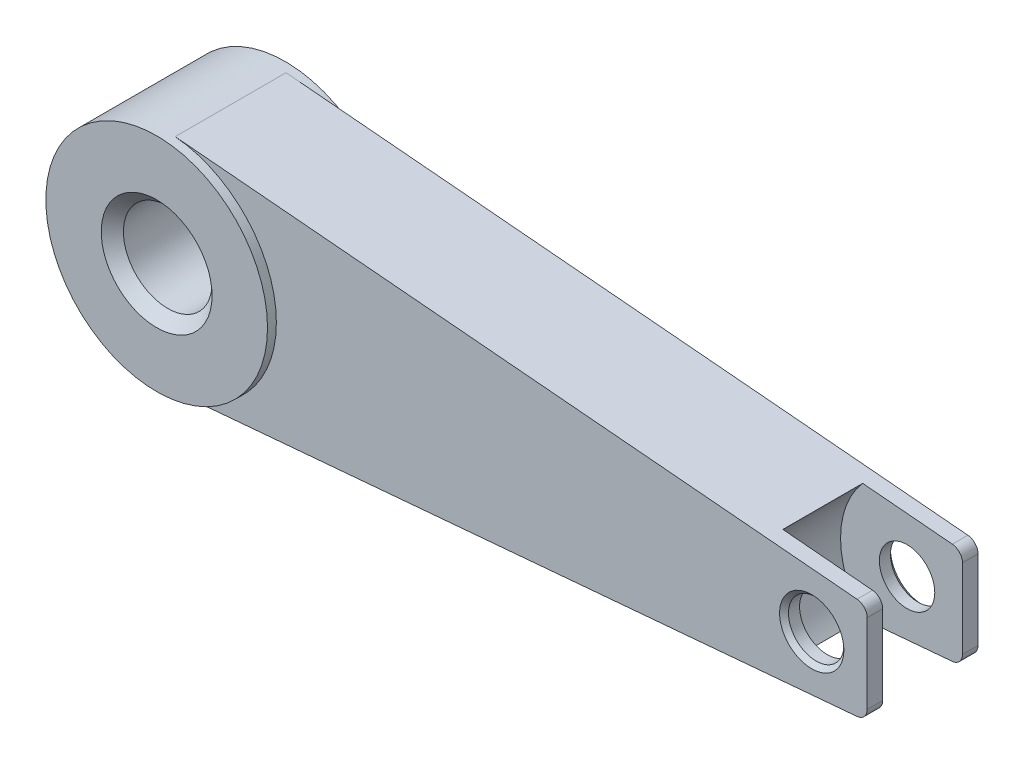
ISO-10303-21;
HEADER;
FILE_DESCRIPTION(('STEP AP214'),'2;1');
FILE_NAME('part.step','',(''),(''),'','','');
FILE_SCHEMA(('AUTOMOTIVE_DESIGN { 1 0 10303 214 1 1 1 1 }'));
ENDSEC;
DATA;
#1=APPLICATION_CONTEXT('core data for automotive mechanical design processes');
#2=APPLICATION_PROTOCOL_DEFINITION('international standard','automotive_design',2000,#1);
#3=PRODUCT_CONTEXT('',#1,'mechanical');
#4=PRODUCT('Part','Part','',(#3));
#5=PRODUCT_RELATED_PRODUCT_CATEGORY('part','',(#4));
#6=PRODUCT_DEFINITION_FORMATION('','',#4);
#7=PRODUCT_DEFINITION_CONTEXT('part definition',#1,'design');
#8=PRODUCT_DEFINITION('design','',#6,#7);
#9=PRODUCT_DEFINITION_SHAPE('','',#8);
#10=(LENGTH_UNIT() NAMED_UNIT(*) SI_UNIT(.MILLI.,.METRE.));
#11=(NAMED_UNIT(*) PLANE_ANGLE_UNIT() SI_UNIT($,.RADIAN.));
#12=(NAMED_UNIT(*) SI_UNIT($,.STERADIAN.) SOLID_ANGLE_UNIT());
#13=UNCERTAINTY_MEASURE_WITH_UNIT(LENGTH_MEASURE(1.E-05),#10,'distance_accuracy_value','');
#14=(GEOMETRIC_REPRESENTATION_CONTEXT(3) GLOBAL_UNCERTAINTY_ASSIGNED_CONTEXT((#13)) GLOBAL_UNIT_ASSIGNED_CONTEXT((#10,
#11,#12)) REPRESENTATION_CONTEXT('',''));
#15=CARTESIAN_POINT('',(0.,0.,0.));
#16=DIRECTION('',(0.,0.,1.));
#17=DIRECTION('',(1.,0.,0.));
#18=AXIS2_PLACEMENT_3D('',#15,#16,#17);
#19=CARTESIAN_POINT('',(31.6509485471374,2.24999999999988,0.4));
#20=DIRECTION('',(1.,0.,0.));
#21=DIRECTION('',(0.,0.,-1.));
#22=AXIS2_PLACEMENT_3D('',#19,#20,#21);
#23=PLANE('',#22);
#24=DIRECTION('',(0.,-1.,0.));
#25=VECTOR('',#24,1.);
#26=CARTESIAN_POINT('',(31.6509485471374,2.24999999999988,1.1));
#27=LINE('',#26,#25);
#28=CARTESIAN_POINT('',(31.6509485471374,1.79183441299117,1.1));
#29=VERTEX_POINT('',#28);
#30=CARTESIAN_POINT('',(31.6509485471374,-1.79183441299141,1.1));
#31=VERTEX_POINT('',#30);
#32=EDGE_CURVE('E144',#29,#31,#27,.T.);
#33=ORIENTED_EDGE('',*,*,#32,.T.);
#34=DIRECTION('',(0.,0.,1.));
#35=VECTOR('',#34,1.);
#36=CARTESIAN_POINT('',(31.6509485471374,-1.79183441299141,0.4));
#37=LINE('',#36,#35);
#38=CARTESIAN_POINT('',(31.6509485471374,-1.79183441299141,0.4));
#39=VERTEX_POINT('',#38);
#40=EDGE_CURVE('E63',#31,#39,#37,.F.);
#41=ORIENTED_EDGE('',*,*,#40,.T.);
#42=DIRECTION('',(0.,1.,0.));
#43=VECTOR('',#42,1.);
#44=CARTESIAN_POINT('',(31.6509485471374,2.24999999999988,0.4));
#45=LINE('',#44,#43);
#46=CARTESIAN_POINT('',(31.6509485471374,1.79183441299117,0.4));
#47=VERTEX_POINT('',#46);
#48=EDGE_CURVE('E183',#39,#47,#45,.T.);
#49=ORIENTED_EDGE('',*,*,#48,.T.);
#50=DIRECTION('',(0.,0.,1.));
#51=VECTOR('',#50,1.);
#52=CARTESIAN_POINT('',(31.6509485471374,1.79183441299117,0.4));
#53=LINE('',#52,#51);
#54=EDGE_CURVE('E295',#47,#29,#53,.T.);
#55=ORIENTED_EDGE('',*,*,#54,.T.);
#56=EDGE_LOOP('',(#33,#41,#49,#55));
#57=FACE_BOUND('',#56,.T.);
#58=ADVANCED_FACE('F41',(#57),#23,.T.);
#59=CARTESIAN_POINT('',(0.,0.,5.8));
#60=DIRECTION('',(0.,0.,-1.));
#61=DIRECTION('',(-1.,0.,0.));
#62=AXIS2_PLACEMENT_3D('',#59,#60,#61);
#63=CYLINDRICAL_SURFACE('',#62,5.);
#64=CARTESIAN_POINT('',(0.,0.,5.4));
#65=DIRECTION('',(0.,0.,1.));
#66=DIRECTION('',(1.,0.,0.));
#67=AXIS2_PLACEMENT_3D('',#64,#65,#66);
#68=CIRCLE('',#67,5.);
#69=CARTESIAN_POINT('',(0.435778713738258,-4.98097349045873,5.4));
#70=VERTEX_POINT('',#69);
#71=CARTESIAN_POINT('',(0.435778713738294,4.98097349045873,5.4));
#72=VERTEX_POINT('',#71);
#73=EDGE_CURVE('E202',#70,#72,#68,.T.);
#74=ORIENTED_EDGE('',*,*,#73,.T.);
#75=DIRECTION('',(0.,0.,1.));
#76=VECTOR('',#75,1.);
#77=CARTESIAN_POINT('',(0.435778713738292,4.98097349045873,0.4));
#78=LINE('',#77,#76);
#79=CARTESIAN_POINT('',(0.435778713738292,4.98097349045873,0.4));
#80=VERTEX_POINT('',#79);
#81=EDGE_CURVE('E190',#80,#72,#78,.T.);
#82=ORIENTED_EDGE('',*,*,#81,.F.);
#83=CARTESIAN_POINT('',(0.,0.,0.399999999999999));
#84=DIRECTION('',(0.,0.,1.));
#85=DIRECTION('',(1.,0.,0.));
#86=AXIS2_PLACEMENT_3D('',#83,#84,#85);
#87=CIRCLE('',#86,5.);
#88=CARTESIAN_POINT('',(0.435778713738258,-4.98097349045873,0.4));
#89=VERTEX_POINT('',#88);
#90=EDGE_CURVE('E209',#89,#80,#87,.T.);
#91=ORIENTED_EDGE('',*,*,#90,.F.);
#92=DIRECTION('',(0.,0.,1.));
#93=VECTOR('',#92,1.);
#94=CARTESIAN_POINT('',(0.435778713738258,-4.98097349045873,0.4));
#95=LINE('',#94,#93);
#96=EDGE_CURVE('E189',#89,#70,#95,.T.);
#97=ORIENTED_EDGE('',*,*,#96,.T.);
#98=EDGE_LOOP('',(#74,#82,#91,#97));
#99=FACE_BOUND('',#98,.T.);
#100=CARTESIAN_POINT('',(0.,0.,5.8));
#101=DIRECTION('',(0.,0.,1.));
#102=DIRECTION('',(1.,0.,0.));
#103=AXIS2_PLACEMENT_3D('',#100,#101,#102);
#104=CIRCLE('',#103,5.);
#105=CARTESIAN_POINT('',(5.,0.,5.8));
#106=VERTEX_POINT('',#105);
#107=EDGE_CURVE('E198',#106,#106,#104,.T.);
#108=ORIENTED_EDGE('',*,*,#107,.F.);
#109=EDGE_LOOP('',(#108));
#110=FACE_BOUND('',#109,.T.);
#111=CARTESIAN_POINT('',(0.,0.,0.));
#112=DIRECTION('',(0.,0.,1.));
#113=DIRECTION('',(1.,0.,0.));
#114=AXIS2_PLACEMENT_3D('',#111,#112,#113);
#115=CIRCLE('',#114,5.);
#116=CARTESIAN_POINT('',(5.,0.,0.));
#117=VERTEX_POINT('',#116);
#118=EDGE_CURVE('E194',#117,#117,#115,.T.);
#119=ORIENTED_EDGE('',*,*,#118,.T.);
#120=EDGE_LOOP('',(#119));
#121=FACE_BOUND('',#120,.T.);
#122=ADVANCED_FACE('F329',(#99,#110,#121),#63,.T.);
#123=CARTESIAN_POINT('',(0.,0.,5.8));
#124=DIRECTION('',(0.,0.,1.));
#125=DIRECTION('',(1.,0.,0.));
#126=AXIS2_PLACEMENT_3D('',#123,#124,#125);
#127=PLANE('',#126);
#128=CARTESIAN_POINT('',(0.,0.,5.8));
#129=DIRECTION('',(0.,0.,1.));
#130=DIRECTION('',(1.,0.,0.));
#131=AXIS2_PLACEMENT_3D('',#128,#129,#130);
#132=CIRCLE('',#131,2.50000000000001);
#133=CARTESIAN_POINT('',(2.50000000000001,0.,5.8));
#134=VERTEX_POINT('',#133);
#135=EDGE_CURVE('E225',#134,#134,#132,.F.);
#136=ORIENTED_EDGE('',*,*,#135,.T.);
#137=EDGE_LOOP('',(#136));
#138=FACE_BOUND('',#137,.T.);
#139=ORIENTED_EDGE('',*,*,#107,.T.);
#140=EDGE_LOOP('',(#139));
#141=FACE_BOUND('',#140,.T.);
#142=ADVANCED_FACE('F352',(#138,#141),#127,.T.);
#143=CARTESIAN_POINT('',(0.,0.,0.));
#144=DIRECTION('',(0.,0.,1.));
#145=DIRECTION('',(1.,0.,0.));
#146=AXIS2_PLACEMENT_3D('',#143,#144,#145);
#147=PLANE('',#146);
#148=CARTESIAN_POINT('',(0.,0.,0.));
#149=DIRECTION('',(0.,0.,1.));
#150=DIRECTION('',(1.,0.,0.));
#151=AXIS2_PLACEMENT_3D('',#148,#149,#150);
#152=CIRCLE('',#151,2.50000000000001);
#153=CARTESIAN_POINT('',(2.50000000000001,0.,0.));
#154=VERTEX_POINT('',#153);
#155=EDGE_CURVE('E213',#154,#154,#152,.T.);
#156=ORIENTED_EDGE('',*,*,#155,.T.);
#157=EDGE_LOOP('',(#156));
#158=FACE_BOUND('',#157,.T.);
#159=ORIENTED_EDGE('',*,*,#118,.F.);
#160=EDGE_LOOP('',(#159));
#161=FACE_BOUND('',#160,.T.);
#162=ADVANCED_FACE('F361',(#158,#161),#147,.F.);
#163=CARTESIAN_POINT('',(0.435778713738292,4.98097349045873,0.4));
#164=DIRECTION('',(0.0871557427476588,0.996194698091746,0.));
#165=DIRECTION('',(-0.996194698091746,0.0871557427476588,0.));
#166=AXIS2_PLACEMENT_3D('',#163,#164,#165);
#167=PLANE('',#166);
#168=DIRECTION('',(-0.996194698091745,0.0871557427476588,0.));
#169=VECTOR('',#168,1.);
#170=CARTESIAN_POINT('',(0.435778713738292,4.98097349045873,5.4));
#171=LINE('',#170,#169);
#172=CARTESIAN_POINT('',(31.1945264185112,2.28993176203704,5.4));
#173=VERTEX_POINT('',#172);
#174=EDGE_CURVE('E176',#173,#72,#171,.T.);
#175=ORIENTED_EDGE('',*,*,#174,.F.);
#176=DIRECTION('',(0.,0.,1.));
#177=VECTOR('',#176,1.);
#178=CARTESIAN_POINT('',(31.1945264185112,2.28993176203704,0.4));
#179=LINE('',#178,#177);
#180=CARTESIAN_POINT('',(31.1945264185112,2.28993176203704,4.7));
#181=VERTEX_POINT('',#180);
#182=EDGE_CURVE('E287',#173,#181,#179,.F.);
#183=ORIENTED_EDGE('',*,*,#182,.T.);
#184=DIRECTION('',(0.996194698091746,-0.0871557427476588,0.));
#185=VECTOR('',#184,1.);
#186=CARTESIAN_POINT('',(0.435778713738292,4.98097349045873,4.7));
#187=LINE('',#186,#185);
#188=CARTESIAN_POINT('',(27.1492692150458,2.64384590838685,4.7));
#189=VERTEX_POINT('',#188);
#190=EDGE_CURVE('E161',#189,#181,#187,.T.);
#191=ORIENTED_EDGE('',*,*,#190,.F.);
#192=DIRECTION('',(0.,0.,-1.));
#193=VECTOR('',#192,1.);
#194=CARTESIAN_POINT('',(27.1492692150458,2.64384590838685,4.7));
#195=LINE('',#194,#193);
#196=CARTESIAN_POINT('',(27.1492692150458,2.64384590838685,1.1));
#197=VERTEX_POINT('',#196);
#198=EDGE_CURVE('E149',#189,#197,#195,.T.);
#199=ORIENTED_EDGE('',*,*,#198,.T.);
#200=DIRECTION('',(0.996194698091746,-0.0871557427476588,0.));
#201=VECTOR('',#200,1.);
#202=CARTESIAN_POINT('',(0.435778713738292,4.98097349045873,1.1));
#203=LINE('',#202,#201);
#204=CARTESIAN_POINT('',(31.1945264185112,2.28993176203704,1.1));
#205=VERTEX_POINT('',#204);
#206=EDGE_CURVE('E131',#197,#205,#203,.T.);
#207=ORIENTED_EDGE('',*,*,#206,.T.);
#208=DIRECTION('',(0.,0.,1.));
#209=VECTOR('',#208,1.);
#210=CARTESIAN_POINT('',(31.1945264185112,2.28993176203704,0.4));
#211=LINE('',#210,#209);
#212=CARTESIAN_POINT('',(31.1945264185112,2.28993176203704,0.4));
#213=VERTEX_POINT('',#212);
#214=EDGE_CURVE('E284',#205,#213,#211,.F.);
#215=ORIENTED_EDGE('',*,*,#214,.T.);
#216=DIRECTION('',(-0.996194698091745,0.0871557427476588,0.));
#217=VECTOR('',#216,1.);
#218=CARTESIAN_POINT('',(0.435778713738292,4.98097349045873,0.4));
#219=LINE('',#218,#217);
#220=EDGE_CURVE('E186',#213,#80,#219,.T.);
#221=ORIENTED_EDGE('',*,*,#220,.T.);
#222=ORIENTED_EDGE('',*,*,#81,.T.);
#223=EDGE_LOOP('',(#175,#183,#191,#199,#207,#215,#221,#222));
#224=FACE_BOUND('',#223,.T.);
#225=ADVANCED_FACE('F159',(#224),#167,.T.);
#226=DIRECTION('',(0.,1.,0.));
#227=VECTOR('',#226,1.);
#228=CARTESIAN_POINT('',(31.6509485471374,2.24999999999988,5.4));
#229=LINE('',#228,#227);
#230=CARTESIAN_POINT('',(31.6509485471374,-1.79183441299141,5.4));
#231=VERTEX_POINT('',#230);
#232=CARTESIAN_POINT('',(31.6509485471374,1.79183441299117,5.4));
#233=VERTEX_POINT('',#232);
#234=EDGE_CURVE('E168',#231,#233,#229,.T.);
#235=ORIENTED_EDGE('',*,*,#234,.F.);
#236=DIRECTION('',(0.,0.,1.));
#237=VECTOR('',#236,1.);
#238=CARTESIAN_POINT('',(31.6509485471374,-1.79183441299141,0.4));
#239=LINE('',#238,#237);
#240=CARTESIAN_POINT('',(31.6509485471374,-1.79183441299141,4.7));
#241=VERTEX_POINT('',#240);
#242=EDGE_CURVE('E275',#231,#241,#239,.F.);
#243=ORIENTED_EDGE('',*,*,#242,.T.);
#244=DIRECTION('',(0.,-1.,0.));
#245=VECTOR('',#244,1.);
#246=CARTESIAN_POINT('',(31.6509485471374,2.24999999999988,4.7));
#247=LINE('',#246,#245);
#248=CARTESIAN_POINT('',(31.6509485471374,1.79183441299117,4.7));
#249=VERTEX_POINT('',#248);
#250=EDGE_CURVE('E143',#249,#241,#247,.T.);
#251=ORIENTED_EDGE('',*,*,#250,.F.);
#252=DIRECTION('',(0.,0.,1.));
#253=VECTOR('',#252,1.);
#254=CARTESIAN_POINT('',(31.6509485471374,1.79183441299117,0.4));
#255=LINE('',#254,#253);
#256=EDGE_CURVE('E271',#249,#233,#255,.T.);
#257=ORIENTED_EDGE('',*,*,#256,.T.);
#258=EDGE_LOOP('',(#235,#243,#251,#257));
#259=FACE_BOUND('',#258,.T.);
#260=ADVANCED_FACE('F348',(#259),#23,.T.);
#261=CARTESIAN_POINT('',(31.6509485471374,-2.25000000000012,0.4));
#262=DIRECTION('',(0.0871557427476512,-0.996194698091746,0.));
#263=DIRECTION('',(0.996194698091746,0.0871557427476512,0.));
#264=AXIS2_PLACEMENT_3D('',#261,#262,#263);
#265=PLANE('',#264);
#266=DIRECTION('',(-0.996194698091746,-0.0871557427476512,0.));
#267=VECTOR('',#266,1.);
#268=CARTESIAN_POINT('',(31.6509485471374,-2.25000000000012,4.7));
#269=LINE('',#268,#267);
#270=CARTESIAN_POINT('',(31.1945264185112,-2.28993176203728,4.7));
#271=VERTEX_POINT('',#270);
#272=CARTESIAN_POINT('',(27.1492692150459,-2.64384590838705,4.7));
#273=VERTEX_POINT('',#272);
#274=EDGE_CURVE('E234',#271,#273,#269,.T.);
#275=ORIENTED_EDGE('',*,*,#274,.F.);
#276=DIRECTION('',(0.,0.,1.));
#277=VECTOR('',#276,1.);
#278=CARTESIAN_POINT('',(31.1945264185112,-2.28993176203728,0.4));
#279=LINE('',#278,#277);
#280=CARTESIAN_POINT('',(31.1945264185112,-2.28993176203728,5.4));
#281=VERTEX_POINT('',#280);
#282=EDGE_CURVE('E261',#271,#281,#279,.T.);
#283=ORIENTED_EDGE('',*,*,#282,.T.);
#284=DIRECTION('',(0.996194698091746,0.0871557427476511,0.));
#285=VECTOR('',#284,1.);
#286=CARTESIAN_POINT('',(31.6509485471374,-2.25000000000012,5.4));
#287=LINE('',#286,#285);
#288=EDGE_CURVE('E163',#70,#281,#287,.T.);
#289=ORIENTED_EDGE('',*,*,#288,.F.);
#290=ORIENTED_EDGE('',*,*,#96,.F.);
#291=DIRECTION('',(0.996194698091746,0.0871557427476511,0.));
#292=VECTOR('',#291,1.);
#293=CARTESIAN_POINT('',(31.6509485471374,-2.25000000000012,0.4));
#294=LINE('',#293,#292);
#295=CARTESIAN_POINT('',(31.1945264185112,-2.28993176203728,0.4));
#296=VERTEX_POINT('',#295);
#297=EDGE_CURVE('E179',#89,#296,#294,.T.);
#298=ORIENTED_EDGE('',*,*,#297,.T.);
#299=DIRECTION('',(0.,0.,1.));
#300=VECTOR('',#299,1.);
#301=CARTESIAN_POINT('',(31.1945264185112,-2.28993176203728,0.4));
#302=LINE('',#301,#300);
#303=CARTESIAN_POINT('',(31.1945264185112,-2.28993176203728,1.1));
#304=VERTEX_POINT('',#303);
#305=EDGE_CURVE('E257',#296,#304,#302,.T.);
#306=ORIENTED_EDGE('',*,*,#305,.T.);
#307=DIRECTION('',(-0.996194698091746,-0.0871557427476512,0.));
#308=VECTOR('',#307,1.);
#309=CARTESIAN_POINT('',(31.6509485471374,-2.25000000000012,1.1));
#310=LINE('',#309,#308);
#311=CARTESIAN_POINT('',(27.1492692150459,-2.64384590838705,1.1));
#312=VERTEX_POINT('',#311);
#313=EDGE_CURVE('E229',#304,#312,#310,.T.);
#314=ORIENTED_EDGE('',*,*,#313,.T.);
#315=DIRECTION('',(0.,0.,-1.));
#316=VECTOR('',#315,1.);
#317=CARTESIAN_POINT('',(27.1492692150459,-2.64384590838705,4.7));
#318=LINE('',#317,#316);
#319=EDGE_CURVE('E152',#312,#273,#318,.F.);
#320=ORIENTED_EDGE('',*,*,#319,.T.);
#321=EDGE_LOOP('',(#275,#283,#289,#290,#298,#306,#314,#320));
#322=FACE_BOUND('',#321,.T.);
#323=ADVANCED_FACE('F323',(#322),#265,.T.);
#324=CARTESIAN_POINT('',(0.,0.,0.4));
#325=DIRECTION('',(0.,0.,1.));
#326=DIRECTION('',(1.,0.,0.));
#327=AXIS2_PLACEMENT_3D('',#324,#325,#326);
#328=PLANE('',#327);
#329=CARTESIAN_POINT('',(29.1509485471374,0.,0.4));
#330=DIRECTION('',(0.,0.,1.));
#331=DIRECTION('',(1.,0.,0.));
#332=AXIS2_PLACEMENT_3D('',#329,#330,#331);
#333=CIRCLE('',#332,1.44999999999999);
#334=CARTESIAN_POINT('',(30.6009485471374,0.,0.4));
#335=VERTEX_POINT('',#334);
#336=EDGE_CURVE('E237',#335,#335,#333,.T.);
#337=ORIENTED_EDGE('',*,*,#336,.T.);
#338=EDGE_LOOP('',(#337));
#339=FACE_BOUND('',#338,.T.);
#340=ORIENTED_EDGE('',*,*,#48,.F.);
#341=CARTESIAN_POINT('',(31.1509485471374,-1.79183441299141,0.4));
#342=DIRECTION('',(0.,0.,1.));
#343=DIRECTION('',(1.,0.,0.));
#344=AXIS2_PLACEMENT_3D('',#341,#342,#343);
#345=CIRCLE('',#344,0.5);
#346=EDGE_CURVE('E11',#39,#296,#345,.F.);
#347=ORIENTED_EDGE('',*,*,#346,.T.);
#348=ORIENTED_EDGE('',*,*,#297,.F.);
#349=ORIENTED_EDGE('',*,*,#90,.T.);
#350=ORIENTED_EDGE('',*,*,#220,.F.);
#351=CARTESIAN_POINT('',(31.1509485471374,1.79183441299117,0.4));
#352=DIRECTION('',(0.,0.,1.));
#353=DIRECTION('',(1.,0.,0.));
#354=AXIS2_PLACEMENT_3D('',#351,#352,#353);
#355=CIRCLE('',#354,0.5);
#356=EDGE_CURVE('E50',#213,#47,#355,.F.);
#357=ORIENTED_EDGE('',*,*,#356,.T.);
#358=EDGE_LOOP('',(#340,#347,#348,#349,#350,#357));
#359=FACE_BOUND('',#358,.T.);
#360=ADVANCED_FACE('F334',(#339,#359),#328,.F.);
#361=CARTESIAN_POINT('',(0.,0.,5.4));
#362=DIRECTION('',(0.,0.,1.));
#363=DIRECTION('',(1.,0.,0.));
#364=AXIS2_PLACEMENT_3D('',#361,#362,#363);
#365=PLANE('',#364);
#366=CARTESIAN_POINT('',(29.1509485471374,0.,5.4));
#367=DIRECTION('',(0.,0.,1.));
#368=DIRECTION('',(1.,0.,0.));
#369=AXIS2_PLACEMENT_3D('',#366,#367,#368);
#370=CIRCLE('',#369,1.45);
#371=CARTESIAN_POINT('',(30.6009485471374,0.,5.4));
#372=VERTEX_POINT('',#371);
#373=EDGE_CURVE('E253',#372,#372,#370,.F.);
#374=ORIENTED_EDGE('',*,*,#373,.T.);
#375=EDGE_LOOP('',(#374));
#376=FACE_BOUND('',#375,.T.);
#377=ORIENTED_EDGE('',*,*,#288,.T.);
#378=CARTESIAN_POINT('',(31.1509485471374,-1.79183441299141,5.4));
#379=DIRECTION('',(0.,0.,1.));
#380=DIRECTION('',(1.,0.,0.));
#381=AXIS2_PLACEMENT_3D('',#378,#379,#380);
#382=CIRCLE('',#381,0.5);
#383=EDGE_CURVE('E268',#281,#231,#382,.T.);
#384=ORIENTED_EDGE('',*,*,#383,.T.);
#385=ORIENTED_EDGE('',*,*,#234,.T.);
#386=CARTESIAN_POINT('',(31.1509485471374,1.79183441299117,5.4));
#387=DIRECTION('',(0.,0.,1.));
#388=DIRECTION('',(1.,0.,0.));
#389=AXIS2_PLACEMENT_3D('',#386,#387,#388);
#390=CIRCLE('',#389,0.5);
#391=EDGE_CURVE('E265',#233,#173,#390,.T.);
#392=ORIENTED_EDGE('',*,*,#391,.T.);
#393=ORIENTED_EDGE('',*,*,#174,.T.);
#394=ORIENTED_EDGE('',*,*,#73,.F.);
#395=EDGE_LOOP('',(#377,#384,#385,#392,#393,#394));
#396=FACE_BOUND('',#395,.T.);
#397=ADVANCED_FACE('F325',(#376,#396),#365,.T.);
#398=CARTESIAN_POINT('',(0.,0.,-6.7));
#399=DIRECTION('',(0.,0.,1.));
#400=DIRECTION('',(1.,0.,0.));
#401=AXIS2_PLACEMENT_3D('',#398,#399,#400);
#402=CYLINDRICAL_SURFACE('',#401,2.);
#403=CARTESIAN_POINT('',(0.,0.,0.500000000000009));
#404=DIRECTION('',(0.,0.,1.));
#405=DIRECTION('',(1.,0.,0.));
#406=AXIS2_PLACEMENT_3D('',#403,#404,#405);
#407=CIRCLE('',#406,2.);
#408=CARTESIAN_POINT('',(2.,0.,0.500000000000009));
#409=VERTEX_POINT('',#408);
#410=EDGE_CURVE('E221',#409,#409,#407,.F.);
#411=ORIENTED_EDGE('',*,*,#410,.T.);
#412=EDGE_LOOP('',(#411));
#413=FACE_BOUND('',#412,.T.);
#414=CARTESIAN_POINT('',(0.,0.,5.3));
#415=DIRECTION('',(0.,0.,1.));
#416=DIRECTION('',(1.,0.,0.));
#417=AXIS2_PLACEMENT_3D('',#414,#415,#416);
#418=CIRCLE('',#417,2.);
#419=CARTESIAN_POINT('',(2.,0.,5.3));
#420=VERTEX_POINT('',#419);
#421=EDGE_CURVE('E217',#420,#420,#418,.T.);
#422=ORIENTED_EDGE('',*,*,#421,.T.);
#423=EDGE_LOOP('',(#422));
#424=FACE_BOUND('',#423,.T.);
#425=ADVANCED_FACE('F374',(#413,#424),#402,.F.);
#426=CARTESIAN_POINT('',(0.,0.,0.));
#427=DIRECTION('',(0.,0.,-1.));
#428=DIRECTION('',(-1.,0.,0.));
#429=AXIS2_PLACEMENT_3D('',#426,#427,#428);
#430=CONICAL_SURFACE('',#429,2.50000000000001,0.785398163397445);
#431=ORIENTED_EDGE('',*,*,#410,.F.);
#432=EDGE_LOOP('',(#431));
#433=FACE_BOUND('',#432,.T.);
#434=ORIENTED_EDGE('',*,*,#155,.F.);
#435=EDGE_LOOP('',(#434));
#436=FACE_BOUND('',#435,.T.);
#437=ADVANCED_FACE('F378',(#433,#436),#430,.F.);
#438=CARTESIAN_POINT('',(0.,0.,5.3));
#439=DIRECTION('',(0.,0.,1.));
#440=DIRECTION('',(1.,0.,0.));
#441=AXIS2_PLACEMENT_3D('',#438,#439,#440);
#442=CONICAL_SURFACE('',#441,2.,0.785398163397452);
#443=ORIENTED_EDGE('',*,*,#135,.F.);
#444=EDGE_LOOP('',(#443));
#445=FACE_BOUND('',#444,.T.);
#446=ORIENTED_EDGE('',*,*,#421,.F.);
#447=EDGE_LOOP('',(#446));
#448=FACE_BOUND('',#447,.T.);
#449=ADVANCED_FACE('F382',(#445,#448),#442,.F.);
#450=CARTESIAN_POINT('',(30.1509485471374,0.,4.7));
#451=DIRECTION('',(0.,0.,-1.));
#452=DIRECTION('',(-1.,0.,0.));
#453=AXIS2_PLACEMENT_3D('',#450,#451,#452);
#454=CYLINDRICAL_SURFACE('',#453,4.00000000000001);
#455=CARTESIAN_POINT('',(30.1509485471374,0.,4.7));
#456=DIRECTION('',(0.,0.,1.));
#457=DIRECTION('',(1.,0.,0.));
#458=AXIS2_PLACEMENT_3D('',#455,#456,#457);
#459=CIRCLE('',#458,4.00000000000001);
#460=EDGE_CURVE('E154',#189,#273,#459,.T.);
#461=ORIENTED_EDGE('',*,*,#460,.T.);
#462=ORIENTED_EDGE('',*,*,#319,.F.);
#463=CARTESIAN_POINT('',(30.1509485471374,0.,1.1));
#464=DIRECTION('',(0.,0.,1.));
#465=DIRECTION('',(1.,0.,0.));
#466=AXIS2_PLACEMENT_3D('',#463,#464,#465);
#467=CIRCLE('',#466,4.00000000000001);
#468=EDGE_CURVE('E135',#197,#312,#467,.T.);
#469=ORIENTED_EDGE('',*,*,#468,.F.);
#470=ORIENTED_EDGE('',*,*,#198,.F.);
#471=EDGE_LOOP('',(#461,#462,#469,#470));
#472=FACE_BOUND('',#471,.T.);
#473=ADVANCED_FACE('F148',(#472),#454,.F.);
#474=CARTESIAN_POINT('',(30.1509485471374,0.,4.7));
#475=DIRECTION('',(0.,0.,1.));
#476=DIRECTION('',(1.,0.,0.));
#477=AXIS2_PLACEMENT_3D('',#474,#475,#476);
#478=PLANE('',#477);
#479=CARTESIAN_POINT('',(29.1509485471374,0.,4.7));
#480=DIRECTION('',(0.,0.,1.));
#481=DIRECTION('',(1.,0.,0.));
#482=AXIS2_PLACEMENT_3D('',#479,#480,#481);
#483=CIRCLE('',#482,1.25);
#484=CARTESIAN_POINT('',(30.4009485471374,0.,4.7));
#485=VERTEX_POINT('',#484);
#486=EDGE_CURVE('E155',#485,#485,#483,.T.);
#487=ORIENTED_EDGE('',*,*,#486,.T.);
#488=EDGE_LOOP('',(#487));
#489=FACE_BOUND('',#488,.T.);
#490=ORIENTED_EDGE('',*,*,#250,.T.);
#491=CARTESIAN_POINT('',(31.1509485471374,-1.79183441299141,4.7));
#492=DIRECTION('',(0.,0.,1.));
#493=DIRECTION('',(1.,0.,0.));
#494=AXIS2_PLACEMENT_3D('',#491,#492,#493);
#495=CIRCLE('',#494,0.5);
#496=EDGE_CURVE('E281',#241,#271,#495,.F.);
#497=ORIENTED_EDGE('',*,*,#496,.T.);
#498=ORIENTED_EDGE('',*,*,#274,.T.);
#499=ORIENTED_EDGE('',*,*,#460,.F.);
#500=ORIENTED_EDGE('',*,*,#190,.T.);
#501=CARTESIAN_POINT('',(31.1509485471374,1.79183441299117,4.7));
#502=DIRECTION('',(0.,0.,1.));
#503=DIRECTION('',(1.,0.,0.));
#504=AXIS2_PLACEMENT_3D('',#501,#502,#503);
#505=CIRCLE('',#504,0.5);
#506=EDGE_CURVE('E278',#181,#249,#505,.F.);
#507=ORIENTED_EDGE('',*,*,#506,.T.);
#508=EDGE_LOOP('',(#490,#497,#498,#499,#500,#507));
#509=FACE_BOUND('',#508,.T.);
#510=ADVANCED_FACE('F312',(#489,#509),#478,.F.);
#511=CARTESIAN_POINT('',(30.1509485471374,0.,1.1));
#512=DIRECTION('',(0.,0.,1.));
#513=DIRECTION('',(1.,0.,0.));
#514=AXIS2_PLACEMENT_3D('',#511,#512,#513);
#515=PLANE('',#514);
#516=CARTESIAN_POINT('',(29.1509485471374,0.,1.1));
#517=DIRECTION('',(0.,0.,1.));
#518=DIRECTION('',(1.,0.,0.));
#519=AXIS2_PLACEMENT_3D('',#516,#517,#518);
#520=CIRCLE('',#519,1.25);
#521=CARTESIAN_POINT('',(30.4009485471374,0.,1.1));
#522=VERTEX_POINT('',#521);
#523=EDGE_CURVE('E238',#522,#522,#520,.T.);
#524=ORIENTED_EDGE('',*,*,#523,.F.);
#525=EDGE_LOOP('',(#524));
#526=FACE_BOUND('',#525,.T.);
#527=ORIENTED_EDGE('',*,*,#313,.F.);
#528=CARTESIAN_POINT('',(31.1509485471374,-1.79183441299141,1.1));
#529=DIRECTION('',(0.,0.,1.));
#530=DIRECTION('',(1.,0.,0.));
#531=AXIS2_PLACEMENT_3D('',#528,#529,#530);
#532=CIRCLE('',#531,0.5);
#533=EDGE_CURVE('E292',#304,#31,#532,.T.);
#534=ORIENTED_EDGE('',*,*,#533,.T.);
#535=ORIENTED_EDGE('',*,*,#32,.F.);
#536=CARTESIAN_POINT('',(31.1509485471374,1.79183441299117,1.1));
#537=DIRECTION('',(0.,0.,1.));
#538=DIRECTION('',(1.,0.,0.));
#539=AXIS2_PLACEMENT_3D('',#536,#537,#538);
#540=CIRCLE('',#539,0.5);
#541=EDGE_CURVE('E138',#29,#205,#540,.T.);
#542=ORIENTED_EDGE('',*,*,#541,.T.);
#543=ORIENTED_EDGE('',*,*,#206,.F.);
#544=ORIENTED_EDGE('',*,*,#468,.T.);
#545=EDGE_LOOP('',(#527,#534,#535,#542,#543,#544));
#546=FACE_BOUND('',#545,.T.);
#547=ADVANCED_FACE('F134',(#526,#546),#515,.T.);
#548=CARTESIAN_POINT('',(29.1509485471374,0.,-1.4));
#549=DIRECTION('',(0.,0.,1.));
#550=DIRECTION('',(1.,0.,0.));
#551=AXIS2_PLACEMENT_3D('',#548,#549,#550);
#552=CYLINDRICAL_SURFACE('',#551,1.25);
#553=CARTESIAN_POINT('',(29.1509485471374,0.,0.599999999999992));
#554=DIRECTION('',(0.,0.,1.));
#555=DIRECTION('',(1.,0.,0.));
#556=AXIS2_PLACEMENT_3D('',#553,#554,#555);
#557=CIRCLE('',#556,1.25);
#558=CARTESIAN_POINT('',(30.4009485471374,0.,0.599999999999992));
#559=VERTEX_POINT('',#558);
#560=EDGE_CURVE('E245',#559,#559,#557,.F.);
#561=ORIENTED_EDGE('',*,*,#560,.T.);
#562=EDGE_LOOP('',(#561));
#563=FACE_BOUND('',#562,.T.);
#564=ORIENTED_EDGE('',*,*,#523,.T.);
#565=EDGE_LOOP('',(#564));
#566=FACE_BOUND('',#565,.T.);
#567=ADVANCED_FACE('F388',(#563,#566),#552,.F.);
#568=CARTESIAN_POINT('',(29.1509485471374,0.,5.2));
#569=DIRECTION('',(0.,0.,1.));
#570=DIRECTION('',(1.,0.,0.));
#571=AXIS2_PLACEMENT_3D('',#568,#569,#570);
#572=CIRCLE('',#571,1.25);
#573=CARTESIAN_POINT('',(30.4009485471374,0.,5.2));
#574=VERTEX_POINT('',#573);
#575=EDGE_CURVE('E249',#574,#574,#572,.T.);
#576=ORIENTED_EDGE('',*,*,#575,.T.);
#577=EDGE_LOOP('',(#576));
#578=FACE_BOUND('',#577,.T.);
#579=ORIENTED_EDGE('',*,*,#486,.F.);
#580=EDGE_LOOP('',(#579));
#581=FACE_BOUND('',#580,.T.);
#582=ADVANCED_FACE('F391',(#578,#581),#552,.F.);
#583=CARTESIAN_POINT('',(29.1509485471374,0.,0.4));
#584=DIRECTION('',(0.,0.,-1.));
#585=DIRECTION('',(-1.,0.,0.));
#586=AXIS2_PLACEMENT_3D('',#583,#584,#585);
#587=CONICAL_SURFACE('',#586,1.44999999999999,0.785398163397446);
#588=ORIENTED_EDGE('',*,*,#560,.F.);
#589=EDGE_LOOP('',(#588));
#590=FACE_BOUND('',#589,.T.);
#591=ORIENTED_EDGE('',*,*,#336,.F.);
#592=EDGE_LOOP('',(#591));
#593=FACE_BOUND('',#592,.T.);
#594=ADVANCED_FACE('F396',(#590,#593),#587,.F.);
#595=CARTESIAN_POINT('',(29.1509485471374,0.,5.2));
#596=DIRECTION('',(0.,0.,1.));
#597=DIRECTION('',(1.,0.,0.));
#598=AXIS2_PLACEMENT_3D('',#595,#596,#597);
#599=CONICAL_SURFACE('',#598,1.25,0.785398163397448);
#600=ORIENTED_EDGE('',*,*,#373,.F.);
#601=EDGE_LOOP('',(#600));
#602=FACE_BOUND('',#601,.T.);
#603=ORIENTED_EDGE('',*,*,#575,.F.);
#604=EDGE_LOOP('',(#603));
#605=FACE_BOUND('',#604,.T.);
#606=ADVANCED_FACE('F404',(#602,#605),#599,.F.);
#607=CARTESIAN_POINT('',(31.1509485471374,-1.79183441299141,0.4));
#608=DIRECTION('',(0.,0.,1.));
#609=DIRECTION('',(1.,0.,0.));
#610=AXIS2_PLACEMENT_3D('',#607,#608,#609);
#611=CYLINDRICAL_SURFACE('',#610,0.5);
#612=ORIENTED_EDGE('',*,*,#496,.F.);
#613=ORIENTED_EDGE('',*,*,#242,.F.);
#614=ORIENTED_EDGE('',*,*,#383,.F.);
#615=ORIENTED_EDGE('',*,*,#282,.F.);
#616=EDGE_LOOP('',(#612,#613,#614,#615));
#617=FACE_BOUND('',#616,.T.);
#618=ADVANCED_FACE('F320',(#617),#611,.T.);
#619=CARTESIAN_POINT('',(31.1509485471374,1.79183441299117,0.4));
#620=DIRECTION('',(0.,0.,1.));
#621=DIRECTION('',(1.,0.,0.));
#622=AXIS2_PLACEMENT_3D('',#619,#620,#621);
#623=CYLINDRICAL_SURFACE('',#622,0.5);
#624=ORIENTED_EDGE('',*,*,#506,.F.);
#625=ORIENTED_EDGE('',*,*,#182,.F.);
#626=ORIENTED_EDGE('',*,*,#391,.F.);
#627=ORIENTED_EDGE('',*,*,#256,.F.);
#628=EDGE_LOOP('',(#624,#625,#626,#627));
#629=FACE_BOUND('',#628,.T.);
#630=ADVANCED_FACE('F339',(#629),#623,.T.);
#631=CARTESIAN_POINT('',(31.1509485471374,-1.79183441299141,0.4));
#632=DIRECTION('',(0.,0.,1.));
#633=DIRECTION('',(1.,0.,0.));
#634=AXIS2_PLACEMENT_3D('',#631,#632,#633);
#635=CYLINDRICAL_SURFACE('',#634,0.5);
#636=ORIENTED_EDGE('',*,*,#346,.F.);
#637=ORIENTED_EDGE('',*,*,#40,.F.);
#638=ORIENTED_EDGE('',*,*,#533,.F.);
#639=ORIENTED_EDGE('',*,*,#305,.F.);
#640=EDGE_LOOP('',(#636,#637,#638,#639));
#641=FACE_BOUND('',#640,.T.);
#642=ADVANCED_FACE('F337',(#641),#635,.T.);
#643=CARTESIAN_POINT('',(31.1509485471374,1.79183441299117,0.4));
#644=DIRECTION('',(0.,0.,1.));
#645=DIRECTION('',(1.,0.,0.));
#646=AXIS2_PLACEMENT_3D('',#643,#644,#645);
#647=CYLINDRICAL_SURFACE('',#646,0.5);
#648=ORIENTED_EDGE('',*,*,#356,.F.);
#649=ORIENTED_EDGE('',*,*,#214,.F.);
#650=ORIENTED_EDGE('',*,*,#541,.F.);
#651=ORIENTED_EDGE('',*,*,#54,.F.);
#652=EDGE_LOOP('',(#648,#649,#650,#651));
#653=FACE_BOUND('',#652,.T.);
#654=ADVANCED_FACE('F43',(#653),#647,.T.);
#655=CLOSED_SHELL('',(#58,#122,#142,#162,#225,#260,#323,#360,#397,#425,#437,#449,#473,#510,#547,
#567,#582,#594,#606,#618,#630,#642,#654));
#656=MANIFOLD_SOLID_BREP('B2',#655);
#657=ADVANCED_BREP_SHAPE_REPRESENTATION('',(#18,#656),#14);
#658=SHAPE_DEFINITION_REPRESENTATION(#9,#657);
ENDSEC;
END-ISO-10303-21;
